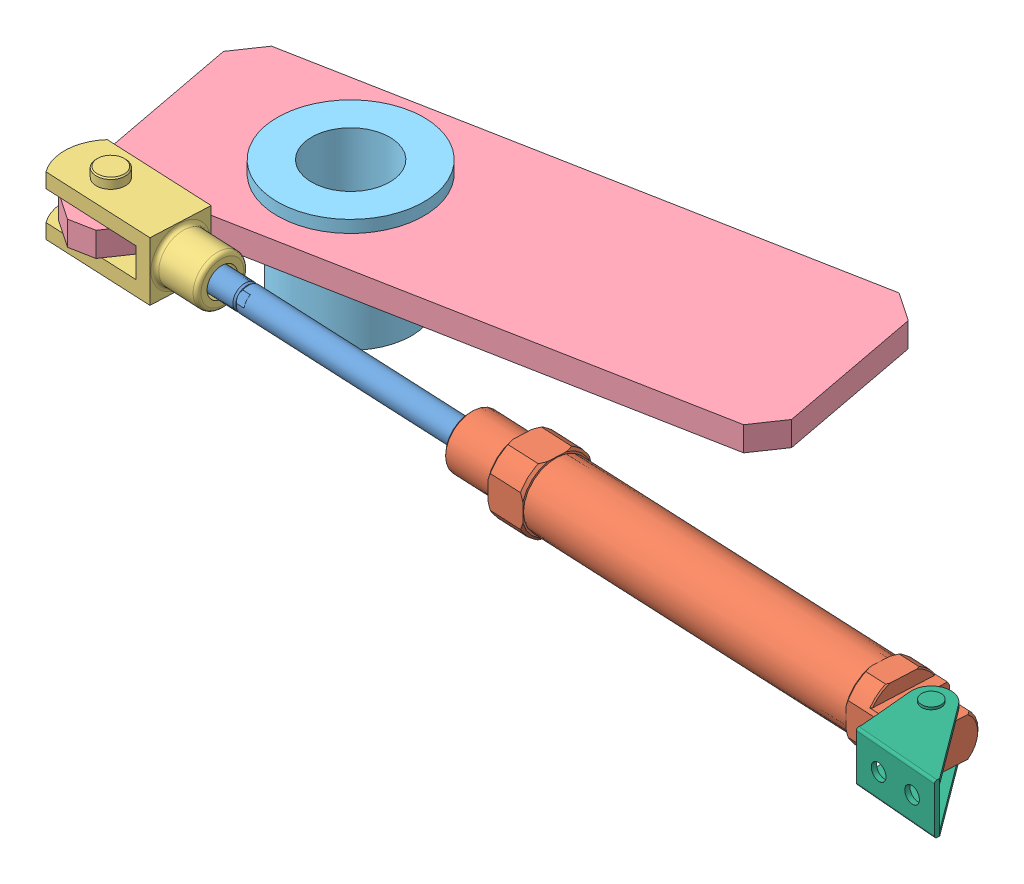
SolidWorks assembly cylinder and finger limited range.SLDASM, configuration Défaut (file format 6000). Lengths in mm.
Overall size (415.77 58.39 174.47).
6 component instances, 6 part files, 8 mates.
Components (placement in the parent):
- CHA_7-Tige verin D25-1: CHA_7-Tige verin D25.sldprt [Défaut] at (-67.5827 -18.4499 58.7667) x (0.038696 -0.568666 -0.821658) z (-0.998893 0 -0.047043) size (25 25 204)
- CHA_7-Corp verin D25-1: CHA_7-Corp verin D25.sldprt [Défaut] at (-131.1081 -18.4499 55.775) x (0.998893 0 0.047043) z (0 1 0) size (207 27 27)
- CHA_7-Charniere_Tige_fix-1: CHA_7-Charniere_Tige_fix.sldprt [Défaut] at (-278.1019 -18.4499 48.8524) x (0 1 0) z (-0.998893 0 -0.047043) size (32 24 67)
- CHA_7-Doigt-2: CHA_7-Doigt.SLDPRT [Défaut] at (-320.0102 -24.4499 64.9739) x (0.982478 0 -0.186379) z (0 1 0) size (240 105 10)
- CHA_7-Entretoise-1: CHA_7-Entretoise.SLDPRT [Défaut] at (-268.2638 -9.4499 -11.0018) x (0.998413 0 0.056311) z (0 -1 0) size (60 60 50)
- CHA_7-Charniere-1: CHA_7-Charniere.sldprt [Défaut] at (44.6971 -18.0887 64.0545) x (0 1 0) z (-0.996507 0 -0.08351) size (22.5 33 38.93)
Mates (geometry in assembly coordinates):
- Verrouiller5: lock: unknown of CHA_7-Tige verin D25-1; unknown of CHA_7-Charniere_Tige_fix-1
- Coaxiale9: concentric anti-aligned: circle of CHA_7-Charniere_Tige_fix-1; cylinder of CHA_7-Doigt-2 through (-308.0687 -14.4499 47.4411) axis (0 -1 0) radius 5.5
- Coïncidente3: coincident anti-aligned: plane of CHA_7-Charniere_Tige_fix-1 through (-308.0687 -24.4499 47.4411) normal (0 1 0); plane of CHA_7-Doigt-2 through (-290.5358 -24.4499 59.3826) normal (0 -1 0)
- Coaxiale15: concentric anti-aligned: cylinder of CHA_7-Doigt-2 through (-268.2638 -14.4499 -11.0018) axis (0 -1 0) radius 25; cylinder of CHA_7-Entretoise-1 through (-268.2638 -59.4499 -11.0018) axis (0 1 0) radius 25
- Distance1: distance = 5 mm aligned: plane of CHA_7-Entretoise-1 through (-268.2638 -9.4499 -11.0018) normal (0 1 0); plane of CHA_7-Doigt-2 through (-290.5358 -14.4499 59.3826) normal (0 1 0)
- Coaxiale16: concentric aligned: cylinder of CHA_7-Tige verin D25-1 through (-106.5395 -18.4499 56.932) axis (0.998893 0 0.047043) radius 12.5; cylinder of CHA_7-Corp verin D25-1 through (-116.1247 -18.4499 56.4806) axis (0.998893 0 0.047043) radius 13.25
- Coaxiale19: concentric anti-aligned: cylinder of CHA_7-Corp verin D25-1 through (44.6971 -26.3999 64.0545) axis (0 1 0) radius 4; cylinder of CHA_7-Charniere-1 through (44.6971 -9.8387 64.0545) axis (0 -1 0) radius 4
- DistanceLimite1: limit distance = 100.4042 mm aligned: plane of CHA_7-Tige verin D25-1 through (-66.7547 -15.238 41.1871) normal (0.998893 0 0.047043); plane of CHA_7-Corp verin D25-1 through (32.1331 -10.4999 75.7482) normal (0.998893 0 0.047043)
